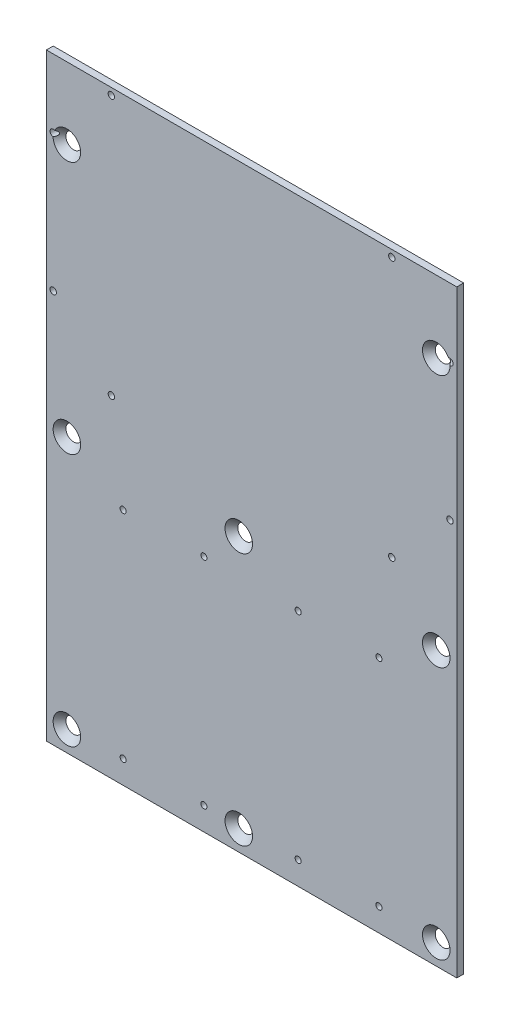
ISO-10303-21;
HEADER;
FILE_DESCRIPTION(('STEP AP214'),'2;1');
FILE_NAME('part.step','',(''),(''),'','','');
FILE_SCHEMA(('AUTOMOTIVE_DESIGN { 1 0 10303 214 1 1 1 1 }'));
ENDSEC;
DATA;
#1=APPLICATION_CONTEXT('core data for automotive mechanical design processes');
#2=APPLICATION_PROTOCOL_DEFINITION('international standard','automotive_design',2000,#1);
#3=PRODUCT_CONTEXT('',#1,'mechanical');
#4=PRODUCT('Part','Part','',(#3));
#5=PRODUCT_RELATED_PRODUCT_CATEGORY('part','',(#4));
#6=PRODUCT_DEFINITION_FORMATION('','',#4);
#7=PRODUCT_DEFINITION_CONTEXT('part definition',#1,'design');
#8=PRODUCT_DEFINITION('design','',#6,#7);
#9=PRODUCT_DEFINITION_SHAPE('','',#8);
#10=(LENGTH_UNIT() NAMED_UNIT(*) SI_UNIT(.MILLI.,.METRE.));
#11=(NAMED_UNIT(*) PLANE_ANGLE_UNIT() SI_UNIT($,.RADIAN.));
#12=(NAMED_UNIT(*) SI_UNIT($,.STERADIAN.) SOLID_ANGLE_UNIT());
#13=UNCERTAINTY_MEASURE_WITH_UNIT(LENGTH_MEASURE(1.E-05),#10,'distance_accuracy_value','');
#14=(GEOMETRIC_REPRESENTATION_CONTEXT(3) GLOBAL_UNCERTAINTY_ASSIGNED_CONTEXT((#13)) GLOBAL_UNIT_ASSIGNED_CONTEXT((#10,
#11,#12)) REPRESENTATION_CONTEXT('',''));
#15=CARTESIAN_POINT('',(0.,0.,0.));
#16=DIRECTION('',(0.,0.,1.));
#17=DIRECTION('',(1.,0.,0.));
#18=AXIS2_PLACEMENT_3D('',#15,#16,#17);
#19=CARTESIAN_POINT('',(0.,0.,0.));
#20=DIRECTION('',(0.,0.,-1.));
#21=DIRECTION('',(-1.,0.,0.));
#22=AXIS2_PLACEMENT_3D('',#19,#20,#21);
#23=PLANE('',#22);
#24=CARTESIAN_POINT('',(-4.74979999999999,-103.505,0.));
#25=DIRECTION('',(0.,0.,-1.));
#26=DIRECTION('',(-1.,0.,0.));
#27=AXIS2_PLACEMENT_3D('',#24,#25,#26);
#28=CIRCLE('',#27,2.90231388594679);
#29=CARTESIAN_POINT('',(-7.65211388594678,-103.505,0.));
#30=VERTEX_POINT('',#29);
#31=EDGE_CURVE('E39',#30,#30,#28,.T.);
#32=ORIENTED_EDGE('',*,*,#31,.F.);
#33=EDGE_LOOP('',(#32));
#34=FACE_BOUND('',#33,.T.);
#35=CARTESIAN_POINT('',(68.58,-103.505,0.));
#36=DIRECTION('',(0.,0.,-1.));
#37=DIRECTION('',(-1.,0.,0.));
#38=AXIS2_PLACEMENT_3D('',#35,#36,#37);
#39=CIRCLE('',#38,2.90231388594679);
#40=CARTESIAN_POINT('',(65.6776861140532,-103.505,0.));
#41=VERTEX_POINT('',#40);
#42=EDGE_CURVE('E313',#41,#41,#39,.T.);
#43=ORIENTED_EDGE('',*,*,#42,.F.);
#44=EDGE_LOOP('',(#43));
#45=FACE_BOUND('',#44,.T.);
#46=CARTESIAN_POINT('',(-68.5799999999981,-9.52500000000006,0.));
#47=DIRECTION('',(0.,0.,-1.));
#48=DIRECTION('',(-1.,0.,0.));
#49=AXIS2_PLACEMENT_3D('',#46,#47,#48);
#50=CIRCLE('',#49,2.90231388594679);
#51=CARTESIAN_POINT('',(-71.4823138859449,-9.52500000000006,0.));
#52=VERTEX_POINT('',#51);
#53=EDGE_CURVE('E322',#52,#52,#50,.T.);
#54=ORIENTED_EDGE('',*,*,#53,.F.);
#55=EDGE_LOOP('',(#54));
#56=FACE_BOUND('',#55,.T.);
#57=CARTESIAN_POINT('',(68.5799999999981,84.4550000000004,0.));
#58=DIRECTION('',(0.,0.,-1.));
#59=DIRECTION('',(-1.,0.,0.));
#60=AXIS2_PLACEMENT_3D('',#57,#58,#59);
#61=CIRCLE('',#60,2.90231388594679);
#62=CARTESIAN_POINT('',(65.6776861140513,84.4550000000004,0.));
#63=VERTEX_POINT('',#62);
#64=EDGE_CURVE('E93',#63,#63,#61,.T.);
#65=ORIENTED_EDGE('',*,*,#64,.F.);
#66=EDGE_LOOP('',(#65));
#67=FACE_BOUND('',#66,.T.);
#68=CARTESIAN_POINT('',(47.3,-22.545,0.));
#69=DIRECTION('',(0.,0.,1.));
#70=DIRECTION('',(1.,0.,0.));
#71=AXIS2_PLACEMENT_3D('',#68,#69,#70);
#72=CIRCLE('',#71,1.1303);
#73=CARTESIAN_POINT('',(48.4303,-22.545,0.));
#74=VERTEX_POINT('',#73);
#75=EDGE_CURVE('E343',#74,#74,#72,.T.);
#76=ORIENTED_EDGE('',*,*,#75,.T.);
#77=EDGE_LOOP('',(#76));
#78=FACE_BOUND('',#77,.T.);
#79=CARTESIAN_POINT('',(-17.7,-22.545,0.));
#80=DIRECTION('',(0.,0.,1.));
#81=DIRECTION('',(1.,0.,0.));
#82=AXIS2_PLACEMENT_3D('',#79,#80,#81);
#83=CIRCLE('',#82,1.1303);
#84=CARTESIAN_POINT('',(-16.5697,-22.545,0.));
#85=VERTEX_POINT('',#84);
#86=EDGE_CURVE('E349',#85,#85,#83,.T.);
#87=ORIENTED_EDGE('',*,*,#86,.T.);
#88=EDGE_LOOP('',(#87));
#89=FACE_BOUND('',#88,.T.);
#90=CARTESIAN_POINT('',(-47.7,-22.545,0.));
#91=DIRECTION('',(0.,0.,1.));
#92=DIRECTION('',(1.,0.,0.));
#93=AXIS2_PLACEMENT_3D('',#90,#91,#92);
#94=CIRCLE('',#93,1.1303);
#95=CARTESIAN_POINT('',(-46.5697,-22.545,0.));
#96=VERTEX_POINT('',#95);
#97=EDGE_CURVE('E355',#96,#96,#94,.T.);
#98=ORIENTED_EDGE('',*,*,#97,.T.);
#99=EDGE_LOOP('',(#98));
#100=FACE_BOUND('',#99,.T.);
#101=CARTESIAN_POINT('',(17.3,-22.545,0.));
#102=DIRECTION('',(0.,0.,1.));
#103=DIRECTION('',(1.,0.,0.));
#104=AXIS2_PLACEMENT_3D('',#101,#102,#103);
#105=CIRCLE('',#104,1.1303);
#106=CARTESIAN_POINT('',(18.4303,-22.545,0.));
#107=VERTEX_POINT('',#106);
#108=EDGE_CURVE('E361',#107,#107,#105,.T.);
#109=ORIENTED_EDGE('',*,*,#108,.T.);
#110=EDGE_LOOP('',(#109));
#111=FACE_BOUND('',#110,.T.);
#112=CARTESIAN_POINT('',(47.3,-102.545,0.));
#113=DIRECTION('',(0.,0.,1.));
#114=DIRECTION('',(1.,0.,0.));
#115=AXIS2_PLACEMENT_3D('',#112,#113,#114);
#116=CIRCLE('',#115,1.1303);
#117=CARTESIAN_POINT('',(48.4303,-102.545,0.));
#118=VERTEX_POINT('',#117);
#119=EDGE_CURVE('E367',#118,#118,#116,.T.);
#120=ORIENTED_EDGE('',*,*,#119,.T.);
#121=EDGE_LOOP('',(#120));
#122=FACE_BOUND('',#121,.T.);
#123=CARTESIAN_POINT('',(17.3,-102.545,0.));
#124=DIRECTION('',(0.,0.,1.));
#125=DIRECTION('',(1.,0.,0.));
#126=AXIS2_PLACEMENT_3D('',#123,#124,#125);
#127=CIRCLE('',#126,1.1303);
#128=CARTESIAN_POINT('',(18.4303,-102.545,0.));
#129=VERTEX_POINT('',#128);
#130=EDGE_CURVE('E373',#129,#129,#127,.T.);
#131=ORIENTED_EDGE('',*,*,#130,.T.);
#132=EDGE_LOOP('',(#131));
#133=FACE_BOUND('',#132,.T.);
#134=CARTESIAN_POINT('',(-17.7,-102.545,0.));
#135=DIRECTION('',(0.,0.,1.));
#136=DIRECTION('',(1.,0.,0.));
#137=AXIS2_PLACEMENT_3D('',#134,#135,#136);
#138=CIRCLE('',#137,1.1303);
#139=CARTESIAN_POINT('',(-16.5697,-102.545,0.));
#140=VERTEX_POINT('',#139);
#141=EDGE_CURVE('E379',#140,#140,#138,.T.);
#142=ORIENTED_EDGE('',*,*,#141,.T.);
#143=EDGE_LOOP('',(#142));
#144=FACE_BOUND('',#143,.T.);
#145=CARTESIAN_POINT('',(-47.7,-102.545,0.));
#146=DIRECTION('',(0.,0.,1.));
#147=DIRECTION('',(1.,0.,0.));
#148=AXIS2_PLACEMENT_3D('',#145,#146,#147);
#149=CIRCLE('',#148,1.1303);
#150=CARTESIAN_POINT('',(-46.5697,-102.545,0.));
#151=VERTEX_POINT('',#150);
#152=EDGE_CURVE('E385',#151,#151,#149,.T.);
#153=ORIENTED_EDGE('',*,*,#152,.T.);
#154=EDGE_LOOP('',(#153));
#155=FACE_BOUND('',#154,.T.);
#156=CARTESIAN_POINT('',(52.07,108.585,0.));
#157=DIRECTION('',(0.,0.,1.));
#158=DIRECTION('',(1.,0.,0.));
#159=AXIS2_PLACEMENT_3D('',#156,#157,#158);
#160=CIRCLE('',#159,1.190625);
#161=CARTESIAN_POINT('',(53.260625,108.585,0.));
#162=VERTEX_POINT('',#161);
#163=EDGE_CURVE('E98',#162,#162,#160,.T.);
#164=ORIENTED_EDGE('',*,*,#163,.T.);
#165=EDGE_LOOP('',(#164));
#166=FACE_BOUND('',#165,.T.);
#167=CARTESIAN_POINT('',(73.66,85.7249999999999,0.));
#168=DIRECTION('',(0.,0.,1.));
#169=DIRECTION('',(1.,0.,0.));
#170=AXIS2_PLACEMENT_3D('',#167,#168,#169);
#171=CIRCLE('',#170,1.190625);
#172=CARTESIAN_POINT('',(74.850625,85.7249999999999,0.));
#173=VERTEX_POINT('',#172);
#174=EDGE_CURVE('E97',#173,#173,#171,.T.);
#175=ORIENTED_EDGE('',*,*,#174,.T.);
#176=EDGE_LOOP('',(#175));
#177=FACE_BOUND('',#176,.T.);
#178=CARTESIAN_POINT('',(73.66,34.9249999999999,0.));
#179=DIRECTION('',(0.,0.,1.));
#180=DIRECTION('',(1.,0.,0.));
#181=AXIS2_PLACEMENT_3D('',#178,#179,#180);
#182=CIRCLE('',#181,1.190625);
#183=CARTESIAN_POINT('',(74.850625,34.9249999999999,0.));
#184=VERTEX_POINT('',#183);
#185=EDGE_CURVE('E110',#184,#184,#182,.T.);
#186=ORIENTED_EDGE('',*,*,#185,.T.);
#187=EDGE_LOOP('',(#186));
#188=FACE_BOUND('',#187,.T.);
#189=CARTESIAN_POINT('',(52.07,12.0649999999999,0.));
#190=DIRECTION('',(0.,0.,1.));
#191=DIRECTION('',(1.,0.,0.));
#192=AXIS2_PLACEMENT_3D('',#189,#190,#191);
#193=CIRCLE('',#192,1.190625);
#194=CARTESIAN_POINT('',(53.260625,12.0649999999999,0.));
#195=VERTEX_POINT('',#194);
#196=EDGE_CURVE('E116',#195,#195,#193,.T.);
#197=ORIENTED_EDGE('',*,*,#196,.T.);
#198=EDGE_LOOP('',(#197));
#199=FACE_BOUND('',#198,.T.);
#200=CARTESIAN_POINT('',(-52.07,12.0649999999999,0.));
#201=DIRECTION('',(0.,0.,1.));
#202=DIRECTION('',(1.,0.,0.));
#203=AXIS2_PLACEMENT_3D('',#200,#201,#202);
#204=CIRCLE('',#203,1.190625);
#205=CARTESIAN_POINT('',(-50.879375,12.0649999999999,0.));
#206=VERTEX_POINT('',#205);
#207=EDGE_CURVE('E122',#206,#206,#204,.T.);
#208=ORIENTED_EDGE('',*,*,#207,.T.);
#209=EDGE_LOOP('',(#208));
#210=FACE_BOUND('',#209,.T.);
#211=CARTESIAN_POINT('',(-73.66,34.9249999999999,0.));
#212=DIRECTION('',(0.,0.,1.));
#213=DIRECTION('',(1.,0.,0.));
#214=AXIS2_PLACEMENT_3D('',#211,#212,#213);
#215=CIRCLE('',#214,1.190625);
#216=CARTESIAN_POINT('',(-72.469375,34.9249999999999,0.));
#217=VERTEX_POINT('',#216);
#218=EDGE_CURVE('E128',#217,#217,#215,.T.);
#219=ORIENTED_EDGE('',*,*,#218,.T.);
#220=EDGE_LOOP('',(#219));
#221=FACE_BOUND('',#220,.T.);
#222=CARTESIAN_POINT('',(-52.07,108.585,0.));
#223=DIRECTION('',(0.,0.,1.));
#224=DIRECTION('',(1.,0.,0.));
#225=AXIS2_PLACEMENT_3D('',#222,#223,#224);
#226=CIRCLE('',#225,1.190625);
#227=CARTESIAN_POINT('',(-50.879375,108.585,0.));
#228=VERTEX_POINT('',#227);
#229=EDGE_CURVE('E134',#228,#228,#226,.T.);
#230=ORIENTED_EDGE('',*,*,#229,.T.);
#231=EDGE_LOOP('',(#230));
#232=FACE_BOUND('',#231,.T.);
#233=CARTESIAN_POINT('',(-73.66,85.7249999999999,0.));
#234=DIRECTION('',(0.,0.,1.));
#235=DIRECTION('',(1.,0.,0.));
#236=AXIS2_PLACEMENT_3D('',#233,#234,#235);
#237=CIRCLE('',#236,1.190625);
#238=CARTESIAN_POINT('',(-72.469375,85.7249999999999,0.));
#239=VERTEX_POINT('',#238);
#240=EDGE_CURVE('E140',#239,#239,#237,.T.);
#241=ORIENTED_EDGE('',*,*,#240,.T.);
#242=EDGE_LOOP('',(#241));
#243=FACE_BOUND('',#242,.T.);
#244=DIRECTION('',(0.,1.,0.));
#245=VECTOR('',#244,1.);
#246=CARTESIAN_POINT('',(76.2,-111.125,0.));
#247=LINE('',#246,#245);
#248=CARTESIAN_POINT('',(76.2,-111.125,0.));
#249=VERTEX_POINT('',#248);
#250=CARTESIAN_POINT('',(76.2,111.125,0.));
#251=VERTEX_POINT('',#250);
#252=EDGE_CURVE('E143',#249,#251,#247,.T.);
#253=ORIENTED_EDGE('',*,*,#252,.F.);
#254=DIRECTION('',(1.,0.,0.));
#255=VECTOR('',#254,1.);
#256=CARTESIAN_POINT('',(-76.2,-111.125,0.));
#257=LINE('',#256,#255);
#258=CARTESIAN_POINT('',(-76.2,-111.125,0.));
#259=VERTEX_POINT('',#258);
#260=EDGE_CURVE('E148',#259,#249,#257,.T.);
#261=ORIENTED_EDGE('',*,*,#260,.F.);
#262=DIRECTION('',(0.,-1.,0.));
#263=VECTOR('',#262,1.);
#264=CARTESIAN_POINT('',(-76.2,-111.125,0.));
#265=LINE('',#264,#263);
#266=CARTESIAN_POINT('',(-76.2,111.125,0.));
#267=VERTEX_POINT('',#266);
#268=EDGE_CURVE('E159',#267,#259,#265,.T.);
#269=ORIENTED_EDGE('',*,*,#268,.F.);
#270=DIRECTION('',(-1.,0.,0.));
#271=VECTOR('',#270,1.);
#272=CARTESIAN_POINT('',(-76.2,111.125,0.));
#273=LINE('',#272,#271);
#274=EDGE_CURVE('E157',#251,#267,#273,.T.);
#275=ORIENTED_EDGE('',*,*,#274,.F.);
#276=EDGE_LOOP('',(#253,#261,#269,#275));
#277=FACE_BOUND('',#276,.T.);
#278=CARTESIAN_POINT('',(-68.5799999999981,84.4550000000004,0.));
#279=DIRECTION('',(0.,0.,-1.));
#280=DIRECTION('',(-1.,0.,0.));
#281=AXIS2_PLACEMENT_3D('',#278,#279,#280);
#282=CIRCLE('',#281,2.90231388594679);
#283=CARTESIAN_POINT('',(-71.4823138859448,84.4550000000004,0.));
#284=VERTEX_POINT('',#283);
#285=EDGE_CURVE('E298',#284,#284,#282,.T.);
#286=ORIENTED_EDGE('',*,*,#285,.F.);
#287=EDGE_LOOP('',(#286));
#288=FACE_BOUND('',#287,.T.);
#289=CARTESIAN_POINT('',(68.5799999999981,-9.52500000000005,0.));
#290=DIRECTION('',(0.,0.,-1.));
#291=DIRECTION('',(-1.,0.,0.));
#292=AXIS2_PLACEMENT_3D('',#289,#290,#291);
#293=CIRCLE('',#292,2.90231388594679);
#294=CARTESIAN_POINT('',(65.6776861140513,-9.52500000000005,0.));
#295=VERTEX_POINT('',#294);
#296=EDGE_CURVE('E94',#295,#295,#293,.T.);
#297=ORIENTED_EDGE('',*,*,#296,.F.);
#298=EDGE_LOOP('',(#297));
#299=FACE_BOUND('',#298,.T.);
#300=CARTESIAN_POINT('',(-4.7498000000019,-9.52500000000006,0.));
#301=DIRECTION('',(0.,0.,-1.));
#302=DIRECTION('',(-1.,0.,0.));
#303=AXIS2_PLACEMENT_3D('',#300,#301,#302);
#304=CIRCLE('',#303,2.90231388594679);
#305=CARTESIAN_POINT('',(-7.65211388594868,-9.52500000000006,0.));
#306=VERTEX_POINT('',#305);
#307=EDGE_CURVE('E305',#306,#306,#304,.T.);
#308=ORIENTED_EDGE('',*,*,#307,.F.);
#309=EDGE_LOOP('',(#308));
#310=FACE_BOUND('',#309,.T.);
#311=CARTESIAN_POINT('',(-68.58,-103.505,0.));
#312=DIRECTION('',(0.,0.,-1.));
#313=DIRECTION('',(-1.,0.,0.));
#314=AXIS2_PLACEMENT_3D('',#311,#312,#313);
#315=CIRCLE('',#314,2.90231388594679);
#316=CARTESIAN_POINT('',(-71.4823138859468,-103.505,0.));
#317=VERTEX_POINT('',#316);
#318=EDGE_CURVE('E308',#317,#317,#315,.T.);
#319=ORIENTED_EDGE('',*,*,#318,.F.);
#320=EDGE_LOOP('',(#319));
#321=FACE_BOUND('',#320,.T.);
#322=ADVANCED_FACE('F35',(#34,#45,#56,#67,#78,#89,#100,#111,#122,#133,#144,#155,#166,#177,#188,
#199,#210,#221,#232,#243,#277,#288,#299,#310,#321),#23,.T.);
#323=CARTESIAN_POINT('',(0.,0.,2.54));
#324=DIRECTION('',(0.,0.,-1.));
#325=DIRECTION('',(-1.,0.,0.));
#326=AXIS2_PLACEMENT_3D('',#323,#324,#325);
#327=PLANE('',#326);
#328=CARTESIAN_POINT('',(-4.74979999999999,-103.505,2.54));
#329=DIRECTION('',(0.,0.,1.));
#330=DIRECTION('',(1.,0.,0.));
#331=AXIS2_PLACEMENT_3D('',#328,#329,#330);
#332=CIRCLE('',#331,5.1103022);
#333=CARTESIAN_POINT('',(0.360502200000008,-103.505,2.54));
#334=VERTEX_POINT('',#333);
#335=EDGE_CURVE('E499',#334,#334,#332,.T.);
#336=ORIENTED_EDGE('',*,*,#335,.F.);
#337=EDGE_LOOP('',(#336));
#338=FACE_BOUND('',#337,.T.);
#339=CARTESIAN_POINT('',(-68.58,-103.505,2.54));
#340=DIRECTION('',(0.,0.,1.));
#341=DIRECTION('',(1.,0.,0.));
#342=AXIS2_PLACEMENT_3D('',#339,#340,#341);
#343=CIRCLE('',#342,5.1103022);
#344=CARTESIAN_POINT('',(-63.4696978,-103.505,2.54));
#345=VERTEX_POINT('',#344);
#346=EDGE_CURVE('E311',#345,#345,#343,.T.);
#347=ORIENTED_EDGE('',*,*,#346,.F.);
#348=EDGE_LOOP('',(#347));
#349=FACE_BOUND('',#348,.T.);
#350=CARTESIAN_POINT('',(68.58,-103.505,2.54));
#351=DIRECTION('',(0.,0.,1.));
#352=DIRECTION('',(1.,0.,0.));
#353=AXIS2_PLACEMENT_3D('',#350,#351,#352);
#354=CIRCLE('',#353,5.1103022);
#355=CARTESIAN_POINT('',(73.6903022,-103.505,2.54));
#356=VERTEX_POINT('',#355);
#357=EDGE_CURVE('E310',#356,#356,#354,.T.);
#358=ORIENTED_EDGE('',*,*,#357,.F.);
#359=EDGE_LOOP('',(#358));
#360=FACE_BOUND('',#359,.T.);
#361=CARTESIAN_POINT('',(-4.7498000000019,-9.52500000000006,2.54));
#362=DIRECTION('',(0.,0.,1.));
#363=DIRECTION('',(1.,0.,0.));
#364=AXIS2_PLACEMENT_3D('',#361,#362,#363);
#365=CIRCLE('',#364,5.1103022);
#366=CARTESIAN_POINT('',(0.360502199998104,-9.52500000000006,2.54));
#367=VERTEX_POINT('',#366);
#368=EDGE_CURVE('E320',#367,#367,#365,.T.);
#369=ORIENTED_EDGE('',*,*,#368,.F.);
#370=EDGE_LOOP('',(#369));
#371=FACE_BOUND('',#370,.T.);
#372=CARTESIAN_POINT('',(-68.5799999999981,-9.52500000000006,2.54));
#373=DIRECTION('',(0.,0.,1.));
#374=DIRECTION('',(1.,0.,0.));
#375=AXIS2_PLACEMENT_3D('',#372,#373,#374);
#376=CIRCLE('',#375,5.1103022);
#377=CARTESIAN_POINT('',(-63.4696977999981,-9.52500000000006,2.54));
#378=VERTEX_POINT('',#377);
#379=EDGE_CURVE('E321',#378,#378,#376,.T.);
#380=ORIENTED_EDGE('',*,*,#379,.F.);
#381=EDGE_LOOP('',(#380));
#382=FACE_BOUND('',#381,.T.);
#383=CARTESIAN_POINT('',(68.5799999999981,-9.52500000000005,2.54));
#384=DIRECTION('',(0.,0.,1.));
#385=DIRECTION('',(1.,0.,0.));
#386=AXIS2_PLACEMENT_3D('',#383,#384,#385);
#387=CIRCLE('',#386,5.1103022);
#388=CARTESIAN_POINT('',(73.6903021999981,-9.52500000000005,2.54));
#389=VERTEX_POINT('',#388);
#390=EDGE_CURVE('E324',#389,#389,#387,.T.);
#391=ORIENTED_EDGE('',*,*,#390,.F.);
#392=EDGE_LOOP('',(#391));
#393=FACE_BOUND('',#392,.T.);
#394=CARTESIAN_POINT('',(-68.5799999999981,84.4550000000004,2.54));
#395=DIRECTION('',(0.,0.,1.));
#396=DIRECTION('',(1.,0.,0.));
#397=AXIS2_PLACEMENT_3D('',#394,#395,#396);
#398=CIRCLE('',#397,5.1103022);
#399=CARTESIAN_POINT('',(-73.6896799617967,84.5347449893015,2.54));
#400=VERTEX_POINT('',#399);
#401=CARTESIAN_POINT('',(-73.1260681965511,86.7891920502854,2.54));
#402=VERTEX_POINT('',#401);
#403=EDGE_CURVE('E57',#400,#402,#398,.T.);
#404=ORIENTED_EDGE('',*,*,#403,.F.);
#405=CARTESIAN_POINT('',(-73.66,85.7249999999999,2.54));
#406=DIRECTION('',(0.,0.,1.));
#407=DIRECTION('',(1.,0.,0.));
#408=AXIS2_PLACEMENT_3D('',#405,#406,#407);
#409=CIRCLE('',#408,1.19062499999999);
#410=EDGE_CURVE('E137',#402,#400,#409,.T.);
#411=ORIENTED_EDGE('',*,*,#410,.F.);
#412=EDGE_LOOP('',(#404,#411));
#413=FACE_BOUND('',#412,.T.);
#414=CARTESIAN_POINT('',(47.3,-22.545,2.54));
#415=DIRECTION('',(0.,0.,1.));
#416=DIRECTION('',(1.,0.,0.));
#417=AXIS2_PLACEMENT_3D('',#414,#415,#416);
#418=CIRCLE('',#417,1.1303);
#419=CARTESIAN_POINT('',(48.4303,-22.545,2.54));
#420=VERTEX_POINT('',#419);
#421=EDGE_CURVE('E340',#420,#420,#418,.T.);
#422=ORIENTED_EDGE('',*,*,#421,.F.);
#423=EDGE_LOOP('',(#422));
#424=FACE_BOUND('',#423,.T.);
#425=CARTESIAN_POINT('',(-17.7,-22.545,2.54));
#426=DIRECTION('',(0.,0.,1.));
#427=DIRECTION('',(1.,0.,0.));
#428=AXIS2_PLACEMENT_3D('',#425,#426,#427);
#429=CIRCLE('',#428,1.1303);
#430=CARTESIAN_POINT('',(-16.5697,-22.545,2.54));
#431=VERTEX_POINT('',#430);
#432=EDGE_CURVE('E346',#431,#431,#429,.T.);
#433=ORIENTED_EDGE('',*,*,#432,.F.);
#434=EDGE_LOOP('',(#433));
#435=FACE_BOUND('',#434,.T.);
#436=CARTESIAN_POINT('',(-47.7,-22.545,2.54));
#437=DIRECTION('',(0.,0.,1.));
#438=DIRECTION('',(1.,0.,0.));
#439=AXIS2_PLACEMENT_3D('',#436,#437,#438);
#440=CIRCLE('',#439,1.1303);
#441=CARTESIAN_POINT('',(-46.5697,-22.545,2.54));
#442=VERTEX_POINT('',#441);
#443=EDGE_CURVE('E352',#442,#442,#440,.T.);
#444=ORIENTED_EDGE('',*,*,#443,.F.);
#445=EDGE_LOOP('',(#444));
#446=FACE_BOUND('',#445,.T.);
#447=CARTESIAN_POINT('',(17.3,-22.545,2.54));
#448=DIRECTION('',(0.,0.,1.));
#449=DIRECTION('',(1.,0.,0.));
#450=AXIS2_PLACEMENT_3D('',#447,#448,#449);
#451=CIRCLE('',#450,1.1303);
#452=CARTESIAN_POINT('',(18.4303,-22.545,2.54));
#453=VERTEX_POINT('',#452);
#454=EDGE_CURVE('E358',#453,#453,#451,.T.);
#455=ORIENTED_EDGE('',*,*,#454,.F.);
#456=EDGE_LOOP('',(#455));
#457=FACE_BOUND('',#456,.T.);
#458=CARTESIAN_POINT('',(47.3,-102.545,2.54));
#459=DIRECTION('',(0.,0.,1.));
#460=DIRECTION('',(1.,0.,0.));
#461=AXIS2_PLACEMENT_3D('',#458,#459,#460);
#462=CIRCLE('',#461,1.1303);
#463=CARTESIAN_POINT('',(48.4303,-102.545,2.54));
#464=VERTEX_POINT('',#463);
#465=EDGE_CURVE('E364',#464,#464,#462,.T.);
#466=ORIENTED_EDGE('',*,*,#465,.F.);
#467=EDGE_LOOP('',(#466));
#468=FACE_BOUND('',#467,.T.);
#469=CARTESIAN_POINT('',(17.3,-102.545,2.54));
#470=DIRECTION('',(0.,0.,1.));
#471=DIRECTION('',(1.,0.,0.));
#472=AXIS2_PLACEMENT_3D('',#469,#470,#471);
#473=CIRCLE('',#472,1.1303);
#474=CARTESIAN_POINT('',(18.4303,-102.545,2.54));
#475=VERTEX_POINT('',#474);
#476=EDGE_CURVE('E370',#475,#475,#473,.T.);
#477=ORIENTED_EDGE('',*,*,#476,.F.);
#478=EDGE_LOOP('',(#477));
#479=FACE_BOUND('',#478,.T.);
#480=CARTESIAN_POINT('',(-17.7,-102.545,2.54));
#481=DIRECTION('',(0.,0.,1.));
#482=DIRECTION('',(1.,0.,0.));
#483=AXIS2_PLACEMENT_3D('',#480,#481,#482);
#484=CIRCLE('',#483,1.1303);
#485=CARTESIAN_POINT('',(-16.5697,-102.545,2.54));
#486=VERTEX_POINT('',#485);
#487=EDGE_CURVE('E376',#486,#486,#484,.T.);
#488=ORIENTED_EDGE('',*,*,#487,.F.);
#489=EDGE_LOOP('',(#488));
#490=FACE_BOUND('',#489,.T.);
#491=CARTESIAN_POINT('',(-47.7,-102.545,2.54));
#492=DIRECTION('',(0.,0.,1.));
#493=DIRECTION('',(1.,0.,0.));
#494=AXIS2_PLACEMENT_3D('',#491,#492,#493);
#495=CIRCLE('',#494,1.1303);
#496=CARTESIAN_POINT('',(-46.5697,-102.545,2.54));
#497=VERTEX_POINT('',#496);
#498=EDGE_CURVE('E382',#497,#497,#495,.T.);
#499=ORIENTED_EDGE('',*,*,#498,.F.);
#500=EDGE_LOOP('',(#499));
#501=FACE_BOUND('',#500,.T.);
#502=CARTESIAN_POINT('',(52.07,108.585,2.54));
#503=DIRECTION('',(0.,0.,1.));
#504=DIRECTION('',(1.,0.,0.));
#505=AXIS2_PLACEMENT_3D('',#502,#503,#504);
#506=CIRCLE('',#505,1.19062499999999);
#507=CARTESIAN_POINT('',(53.260625,108.585,2.54));
#508=VERTEX_POINT('',#507);
#509=EDGE_CURVE('E104',#508,#508,#506,.T.);
#510=ORIENTED_EDGE('',*,*,#509,.F.);
#511=EDGE_LOOP('',(#510));
#512=FACE_BOUND('',#511,.T.);
#513=CARTESIAN_POINT('',(73.66,34.9249999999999,2.54));
#514=DIRECTION('',(0.,0.,1.));
#515=DIRECTION('',(1.,0.,0.));
#516=AXIS2_PLACEMENT_3D('',#513,#514,#515);
#517=CIRCLE('',#516,1.19062499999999);
#518=CARTESIAN_POINT('',(74.850625,34.9249999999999,2.54));
#519=VERTEX_POINT('',#518);
#520=EDGE_CURVE('E101',#519,#519,#517,.T.);
#521=ORIENTED_EDGE('',*,*,#520,.F.);
#522=EDGE_LOOP('',(#521));
#523=FACE_BOUND('',#522,.T.);
#524=CARTESIAN_POINT('',(52.07,12.0649999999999,2.54));
#525=DIRECTION('',(0.,0.,1.));
#526=DIRECTION('',(1.,0.,0.));
#527=AXIS2_PLACEMENT_3D('',#524,#525,#526);
#528=CIRCLE('',#527,1.19062499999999);
#529=CARTESIAN_POINT('',(53.260625,12.0649999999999,2.54));
#530=VERTEX_POINT('',#529);
#531=EDGE_CURVE('E113',#530,#530,#528,.T.);
#532=ORIENTED_EDGE('',*,*,#531,.F.);
#533=EDGE_LOOP('',(#532));
#534=FACE_BOUND('',#533,.T.);
#535=CARTESIAN_POINT('',(-52.07,12.0649999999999,2.54));
#536=DIRECTION('',(0.,0.,1.));
#537=DIRECTION('',(1.,0.,0.));
#538=AXIS2_PLACEMENT_3D('',#535,#536,#537);
#539=CIRCLE('',#538,1.19062499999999);
#540=CARTESIAN_POINT('',(-50.879375,12.0649999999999,2.54));
#541=VERTEX_POINT('',#540);
#542=EDGE_CURVE('E119',#541,#541,#539,.T.);
#543=ORIENTED_EDGE('',*,*,#542,.F.);
#544=EDGE_LOOP('',(#543));
#545=FACE_BOUND('',#544,.T.);
#546=CARTESIAN_POINT('',(-73.66,34.9249999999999,2.54));
#547=DIRECTION('',(0.,0.,1.));
#548=DIRECTION('',(1.,0.,0.));
#549=AXIS2_PLACEMENT_3D('',#546,#547,#548);
#550=CIRCLE('',#549,1.19062499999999);
#551=CARTESIAN_POINT('',(-72.469375,34.9249999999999,2.54));
#552=VERTEX_POINT('',#551);
#553=EDGE_CURVE('E125',#552,#552,#550,.T.);
#554=ORIENTED_EDGE('',*,*,#553,.F.);
#555=EDGE_LOOP('',(#554));
#556=FACE_BOUND('',#555,.T.);
#557=CARTESIAN_POINT('',(-52.07,108.585,2.54));
#558=DIRECTION('',(0.,0.,1.));
#559=DIRECTION('',(1.,0.,0.));
#560=AXIS2_PLACEMENT_3D('',#557,#558,#559);
#561=CIRCLE('',#560,1.19062499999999);
#562=CARTESIAN_POINT('',(-50.879375,108.585,2.54));
#563=VERTEX_POINT('',#562);
#564=EDGE_CURVE('E131',#563,#563,#561,.T.);
#565=ORIENTED_EDGE('',*,*,#564,.F.);
#566=EDGE_LOOP('',(#565));
#567=FACE_BOUND('',#566,.T.);
#568=DIRECTION('',(0.,1.,0.));
#569=VECTOR('',#568,1.);
#570=CARTESIAN_POINT('',(76.2,-111.125,2.54));
#571=LINE('',#570,#569);
#572=CARTESIAN_POINT('',(76.2,-111.125,2.54));
#573=VERTEX_POINT('',#572);
#574=CARTESIAN_POINT('',(76.2,111.125,2.54));
#575=VERTEX_POINT('',#574);
#576=EDGE_CURVE('E144',#573,#575,#571,.T.);
#577=ORIENTED_EDGE('',*,*,#576,.T.);
#578=DIRECTION('',(-1.,0.,0.));
#579=VECTOR('',#578,1.);
#580=CARTESIAN_POINT('',(-76.2,111.125,2.54));
#581=LINE('',#580,#579);
#582=CARTESIAN_POINT('',(-76.2,111.125,2.54));
#583=VERTEX_POINT('',#582);
#584=EDGE_CURVE('E147',#575,#583,#581,.T.);
#585=ORIENTED_EDGE('',*,*,#584,.T.);
#586=DIRECTION('',(0.,-1.,0.));
#587=VECTOR('',#586,1.);
#588=CARTESIAN_POINT('',(-76.2,-111.125,2.54));
#589=LINE('',#588,#587);
#590=CARTESIAN_POINT('',(-76.2,-111.125,2.54));
#591=VERTEX_POINT('',#590);
#592=EDGE_CURVE('E150',#583,#591,#589,.T.);
#593=ORIENTED_EDGE('',*,*,#592,.T.);
#594=DIRECTION('',(1.,0.,0.));
#595=VECTOR('',#594,1.);
#596=CARTESIAN_POINT('',(-76.2,-111.125,2.54));
#597=LINE('',#596,#595);
#598=EDGE_CURVE('E152',#591,#573,#597,.T.);
#599=ORIENTED_EDGE('',*,*,#598,.T.);
#600=EDGE_LOOP('',(#577,#585,#593,#599));
#601=FACE_BOUND('',#600,.T.);
#602=CARTESIAN_POINT('',(68.5799999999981,84.4550000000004,2.54));
#603=DIRECTION('',(0.,0.,1.));
#604=DIRECTION('',(1.,0.,0.));
#605=AXIS2_PLACEMENT_3D('',#602,#603,#604);
#606=CIRCLE('',#605,5.1103022);
#607=CARTESIAN_POINT('',(73.1260681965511,86.7891920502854,2.54));
#608=VERTEX_POINT('',#607);
#609=CARTESIAN_POINT('',(73.6896799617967,84.5347449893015,2.54));
#610=VERTEX_POINT('',#609);
#611=EDGE_CURVE('E51',#608,#610,#606,.T.);
#612=ORIENTED_EDGE('',*,*,#611,.F.);
#613=CARTESIAN_POINT('',(73.66,85.7249999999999,2.54));
#614=DIRECTION('',(0.,0.,1.));
#615=DIRECTION('',(1.,0.,0.));
#616=AXIS2_PLACEMENT_3D('',#613,#614,#615);
#617=CIRCLE('',#616,1.19062499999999);
#618=EDGE_CURVE('E92',#610,#608,#617,.T.);
#619=ORIENTED_EDGE('',*,*,#618,.F.);
#620=EDGE_LOOP('',(#612,#619));
#621=FACE_BOUND('',#620,.T.);
#622=ADVANCED_FACE('F91',(#338,#349,#360,#371,#382,#393,#413,#424,#435,#446,#457,#468,#479,#490,
#501,#512,#523,#534,#545,#556,#567,#601,#621),#327,.F.);
#623=CARTESIAN_POINT('',(76.2,-111.125,2.54));
#624=DIRECTION('',(-1.,0.,0.));
#625=DIRECTION('',(0.,0.,1.));
#626=AXIS2_PLACEMENT_3D('',#623,#624,#625);
#627=PLANE('',#626);
#628=ORIENTED_EDGE('',*,*,#252,.T.);
#629=DIRECTION('',(0.,0.,-1.));
#630=VECTOR('',#629,1.);
#631=CARTESIAN_POINT('',(76.2,111.125,2.54));
#632=LINE('',#631,#630);
#633=EDGE_CURVE('E170',#575,#251,#632,.T.);
#634=ORIENTED_EDGE('',*,*,#633,.F.);
#635=ORIENTED_EDGE('',*,*,#576,.F.);
#636=DIRECTION('',(0.,0.,-1.));
#637=VECTOR('',#636,1.);
#638=CARTESIAN_POINT('',(76.2,-111.125,2.54));
#639=LINE('',#638,#637);
#640=EDGE_CURVE('E154',#573,#249,#639,.T.);
#641=ORIENTED_EDGE('',*,*,#640,.T.);
#642=EDGE_LOOP('',(#628,#634,#635,#641));
#643=FACE_BOUND('',#642,.T.);
#644=ADVANCED_FACE('F37',(#643),#627,.F.);
#645=CARTESIAN_POINT('',(-76.2,111.125,2.54));
#646=DIRECTION('',(0.,-1.,0.));
#647=DIRECTION('',(0.,0.,-1.));
#648=AXIS2_PLACEMENT_3D('',#645,#646,#647);
#649=PLANE('',#648);
#650=ORIENTED_EDGE('',*,*,#274,.T.);
#651=DIRECTION('',(0.,0.,-1.));
#652=VECTOR('',#651,1.);
#653=CARTESIAN_POINT('',(-76.2,111.125,2.54));
#654=LINE('',#653,#652);
#655=EDGE_CURVE('E167',#583,#267,#654,.T.);
#656=ORIENTED_EDGE('',*,*,#655,.F.);
#657=ORIENTED_EDGE('',*,*,#584,.F.);
#658=ORIENTED_EDGE('',*,*,#633,.T.);
#659=EDGE_LOOP('',(#650,#656,#657,#658));
#660=FACE_BOUND('',#659,.T.);
#661=ADVANCED_FACE('F274',(#660),#649,.F.);
#662=CARTESIAN_POINT('',(-76.2,-111.125,2.54));
#663=DIRECTION('',(1.,0.,0.));
#664=DIRECTION('',(0.,0.,-1.));
#665=AXIS2_PLACEMENT_3D('',#662,#663,#664);
#666=PLANE('',#665);
#667=ORIENTED_EDGE('',*,*,#268,.T.);
#668=DIRECTION('',(0.,0.,-1.));
#669=VECTOR('',#668,1.);
#670=CARTESIAN_POINT('',(-76.2,-111.125,2.54));
#671=LINE('',#670,#669);
#672=EDGE_CURVE('E164',#591,#259,#671,.T.);
#673=ORIENTED_EDGE('',*,*,#672,.F.);
#674=ORIENTED_EDGE('',*,*,#592,.F.);
#675=ORIENTED_EDGE('',*,*,#655,.T.);
#676=EDGE_LOOP('',(#667,#673,#674,#675));
#677=FACE_BOUND('',#676,.T.);
#678=ADVANCED_FACE('F271',(#677),#666,.F.);
#679=CARTESIAN_POINT('',(-76.2,-111.125,2.54));
#680=DIRECTION('',(0.,1.,0.));
#681=DIRECTION('',(0.,0.,1.));
#682=AXIS2_PLACEMENT_3D('',#679,#680,#681);
#683=PLANE('',#682);
#684=ORIENTED_EDGE('',*,*,#260,.T.);
#685=ORIENTED_EDGE('',*,*,#640,.F.);
#686=ORIENTED_EDGE('',*,*,#598,.F.);
#687=ORIENTED_EDGE('',*,*,#672,.T.);
#688=EDGE_LOOP('',(#684,#685,#686,#687));
#689=FACE_BOUND('',#688,.T.);
#690=ADVANCED_FACE('F255',(#689),#683,.F.);
#691=CARTESIAN_POINT('',(-73.66,85.7249999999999,2.54));
#692=DIRECTION('',(0.,0.,1.));
#693=DIRECTION('',(1.,0.,0.));
#694=AXIS2_PLACEMENT_3D('',#691,#692,#693);
#695=CYLINDRICAL_SURFACE('',#694,1.19062499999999);
#696=ORIENTED_EDGE('',*,*,#240,.F.);
#697=EDGE_LOOP('',(#696));
#698=FACE_BOUND('',#697,.T.);
#699=ORIENTED_EDGE('',*,*,#410,.T.);
#700=CARTESIAN_POINT('',(-73.6898537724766,84.5347493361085,2.5402));
#701=CARTESIAN_POINT('',(-73.640784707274,84.5335445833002,2.48375372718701));
#702=CARTESIAN_POINT('',(-73.5916619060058,84.5353243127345,2.42726845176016));
#703=CARTESIAN_POINT('',(-73.4934796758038,84.5450358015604,2.31452224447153));
#704=CARTESIAN_POINT('',(-73.4444207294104,84.5529832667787,2.25826225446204));
#705=CARTESIAN_POINT('',(-73.3462321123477,84.5753484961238,2.14592273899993));
#706=CARTESIAN_POINT('',(-73.2971080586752,84.5898392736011,2.08985264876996));
#707=CARTESIAN_POINT('',(-73.1997485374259,84.6257063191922,1.97926145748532));
#708=CARTESIAN_POINT('',(-73.1515120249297,84.6470738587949,1.92473848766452));
#709=CARTESIAN_POINT('',(-73.0571071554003,84.6969382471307,1.81901355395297));
#710=CARTESIAN_POINT('',(-73.0109175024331,84.7253062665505,1.76777062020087));
#711=CARTESIAN_POINT('',(-72.9204291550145,84.7902704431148,1.6690684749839));
#712=CARTESIAN_POINT('',(-72.8761263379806,84.8268474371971,1.62160079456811));
#713=CARTESIAN_POINT('',(-72.7994945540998,84.9007911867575,1.54208583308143));
#714=CARTESIAN_POINT('',(-72.7666173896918,84.9363487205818,1.50890220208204));
#715=CARTESIAN_POINT('',(-72.7036075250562,85.0140900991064,1.4480913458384));
#716=CARTESIAN_POINT('',(-72.6734696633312,85.0562610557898,1.42045354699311));
#717=CARTESIAN_POINT('',(-72.6255049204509,85.1343559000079,1.38008026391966));
#718=CARTESIAN_POINT('',(-72.6066297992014,85.1685898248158,1.36534481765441));
#719=CARTESIAN_POINT('',(-72.571793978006,85.2402555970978,1.34110303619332));
#720=CARTESIAN_POINT('',(-72.5558300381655,85.2776838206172,1.33159086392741));
#721=CARTESIAN_POINT('',(-72.5274894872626,85.3552408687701,1.31868893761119));
#722=CARTESIAN_POINT('',(-72.5151402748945,85.3953876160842,1.31534497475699));
#723=CARTESIAN_POINT('',(-72.4947840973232,85.4767697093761,1.31532962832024));
#724=CARTESIAN_POINT('',(-72.4867768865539,85.5180049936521,1.31865786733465));
#725=CARTESIAN_POINT('',(-72.4758038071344,85.5959263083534,1.33091973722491));
#726=CARTESIAN_POINT('',(-72.4724108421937,85.6326516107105,1.3392540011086));
#727=CARTESIAN_POINT('',(-72.4689921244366,85.7049752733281,1.36027743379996));
#728=CARTESIAN_POINT('',(-72.4689678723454,85.7405731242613,1.3729685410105));
#729=CARTESIAN_POINT('',(-72.472683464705,85.8283429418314,1.40946392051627));
#730=CARTESIAN_POINT('',(-72.4783971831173,85.8794536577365,1.43560977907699));
#731=CARTESIAN_POINT('',(-72.4953560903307,85.977336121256,1.49359502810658));
#732=CARTESIAN_POINT('',(-72.506615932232,86.024095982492,1.52544935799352));
#733=CARTESIAN_POINT('',(-72.541611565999,86.1401836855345,1.61331063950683));
#734=CARTESIAN_POINT('',(-72.568778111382,86.2061779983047,1.67232448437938));
#735=CARTESIAN_POINT('',(-72.6314088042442,86.3286003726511,1.79589213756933));
#736=CARTESIAN_POINT('',(-72.6669109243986,86.3849825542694,1.86047041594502));
#737=CARTESIAN_POINT('',(-72.7347644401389,86.4759215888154,1.97613367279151));
#738=CARTESIAN_POINT('',(-72.7656890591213,86.5124128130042,2.02656152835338));
#739=CARTESIAN_POINT('',(-72.8307872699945,86.5806993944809,2.12854973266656));
#740=CARTESIAN_POINT('',(-72.8649632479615,86.6124912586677,2.1801108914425));
#741=CARTESIAN_POINT('',(-72.9356047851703,86.6709968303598,2.28300963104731));
#742=CARTESIAN_POINT('',(-72.9720236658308,86.6977851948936,2.33433703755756));
#743=CARTESIAN_POINT('',(-73.047327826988,86.746873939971,2.43718552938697));
#744=CARTESIAN_POINT('',(-73.0862090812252,86.7691814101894,2.48870617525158));
#745=CARTESIAN_POINT('',(-73.126223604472,86.7892700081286,2.54020000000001));
#746=B_SPLINE_CURVE_WITH_KNOTS('',3,(#700,#701,#702,#703,#704,#705,#706,#707,#708,#709,#710,
#711,#712,#713,#714,#715,#716,#717,#718,#719,#720,#721,#722,#723,#724,#725,#726,#727,#728,#729,
#730,#731,#732,#733,#734,#735,#736,#737,#738,#739,#740,#741,#742,#743,#744,#745),.UNSPECIFIED.,
.F.,.F.,(4,2,2,2,2,2,2,2,2,2,2,2,2,2,2,2,2,2,2,2,2,2,4),(0.,0.224372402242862,0.449318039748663,
0.676838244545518,0.904070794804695,1.1273983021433,1.35020979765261,1.52581430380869,
1.70108075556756,1.82595516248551,1.95068973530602,2.07634663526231,2.20199642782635,
2.31497018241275,2.42799426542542,2.60008871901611,2.77264031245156,3.04893221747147,
3.32650806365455,3.53477413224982,3.74319423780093,3.9482000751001,4.15287895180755),.UNSPECIFIED.);
#747=EDGE_CURVE('E44',#400,#402,#746,.T.);
#748=ORIENTED_EDGE('',*,*,#747,.T.);
#749=EDGE_LOOP('',(#699,#748));
#750=FACE_BOUND('',#749,.T.);
#751=ADVANCED_FACE('F184',(#698,#750),#695,.F.);
#752=CARTESIAN_POINT('',(-52.07,108.585,2.54));
#753=DIRECTION('',(0.,0.,1.));
#754=DIRECTION('',(1.,0.,0.));
#755=AXIS2_PLACEMENT_3D('',#752,#753,#754);
#756=CYLINDRICAL_SURFACE('',#755,1.19062499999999);
#757=ORIENTED_EDGE('',*,*,#229,.F.);
#758=EDGE_LOOP('',(#757));
#759=FACE_BOUND('',#758,.T.);
#760=ORIENTED_EDGE('',*,*,#564,.T.);
#761=EDGE_LOOP('',(#760));
#762=FACE_BOUND('',#761,.T.);
#763=ADVANCED_FACE('F248',(#759,#762),#756,.F.);
#764=CARTESIAN_POINT('',(-73.66,34.9249999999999,2.54));
#765=DIRECTION('',(0.,0.,1.));
#766=DIRECTION('',(1.,0.,0.));
#767=AXIS2_PLACEMENT_3D('',#764,#765,#766);
#768=CYLINDRICAL_SURFACE('',#767,1.19062499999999);
#769=ORIENTED_EDGE('',*,*,#218,.F.);
#770=EDGE_LOOP('',(#769));
#771=FACE_BOUND('',#770,.T.);
#772=ORIENTED_EDGE('',*,*,#553,.T.);
#773=EDGE_LOOP('',(#772));
#774=FACE_BOUND('',#773,.T.);
#775=ADVANCED_FACE('F245',(#771,#774),#768,.F.);
#776=CARTESIAN_POINT('',(-52.07,12.0649999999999,2.54));
#777=DIRECTION('',(0.,0.,1.));
#778=DIRECTION('',(1.,0.,0.));
#779=AXIS2_PLACEMENT_3D('',#776,#777,#778);
#780=CYLINDRICAL_SURFACE('',#779,1.19062499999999);
#781=ORIENTED_EDGE('',*,*,#207,.F.);
#782=EDGE_LOOP('',(#781));
#783=FACE_BOUND('',#782,.T.);
#784=ORIENTED_EDGE('',*,*,#542,.T.);
#785=EDGE_LOOP('',(#784));
#786=FACE_BOUND('',#785,.T.);
#787=ADVANCED_FACE('F241',(#783,#786),#780,.F.);
#788=CARTESIAN_POINT('',(52.07,12.0649999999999,2.54));
#789=DIRECTION('',(0.,0.,1.));
#790=DIRECTION('',(1.,0.,0.));
#791=AXIS2_PLACEMENT_3D('',#788,#789,#790);
#792=CYLINDRICAL_SURFACE('',#791,1.19062499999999);
#793=ORIENTED_EDGE('',*,*,#196,.F.);
#794=EDGE_LOOP('',(#793));
#795=FACE_BOUND('',#794,.T.);
#796=ORIENTED_EDGE('',*,*,#531,.T.);
#797=EDGE_LOOP('',(#796));
#798=FACE_BOUND('',#797,.T.);
#799=ADVANCED_FACE('F237',(#795,#798),#792,.F.);
#800=CARTESIAN_POINT('',(73.66,34.9249999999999,2.54));
#801=DIRECTION('',(0.,0.,1.));
#802=DIRECTION('',(1.,0.,0.));
#803=AXIS2_PLACEMENT_3D('',#800,#801,#802);
#804=CYLINDRICAL_SURFACE('',#803,1.19062499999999);
#805=ORIENTED_EDGE('',*,*,#185,.F.);
#806=EDGE_LOOP('',(#805));
#807=FACE_BOUND('',#806,.T.);
#808=ORIENTED_EDGE('',*,*,#520,.T.);
#809=EDGE_LOOP('',(#808));
#810=FACE_BOUND('',#809,.T.);
#811=ADVANCED_FACE('F233',(#807,#810),#804,.F.);
#812=CARTESIAN_POINT('',(73.66,85.7249999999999,2.54));
#813=DIRECTION('',(0.,0.,1.));
#814=DIRECTION('',(1.,0.,0.));
#815=AXIS2_PLACEMENT_3D('',#812,#813,#814);
#816=CYLINDRICAL_SURFACE('',#815,1.19062499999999);
#817=ORIENTED_EDGE('',*,*,#174,.F.);
#818=EDGE_LOOP('',(#817));
#819=FACE_BOUND('',#818,.T.);
#820=ORIENTED_EDGE('',*,*,#618,.T.);
#821=CARTESIAN_POINT('',(73.1262236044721,86.7892700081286,2.54020000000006));
#822=CARTESIAN_POINT('',(73.0823604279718,86.7672417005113,2.48375372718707));
#823=CARTESIAN_POINT('',(73.0398542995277,86.7425547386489,2.42726845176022));
#824=CARTESIAN_POINT('',(72.9577930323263,86.6877823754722,2.3145222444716));
#825=CARTESIAN_POINT('',(72.9182457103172,86.6576833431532,2.25826225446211));
#826=CARTESIAN_POINT('',(72.8421335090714,86.5917429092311,2.145922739));
#827=CARTESIAN_POINT('',(72.805607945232,86.5558397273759,2.08985264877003));
#828=CARTESIAN_POINT('',(72.736581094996,86.4783760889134,1.97926145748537));
#829=CARTESIAN_POINT('',(72.7040747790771,86.436822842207,1.92473848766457));
#830=CARTESIAN_POINT('',(72.6442419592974,86.3483990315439,1.81901355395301));
#831=CARTESIAN_POINT('',(72.6168360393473,86.3016321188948,1.76777062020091));
#832=CARTESIAN_POINT('',(72.5675647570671,86.2017280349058,1.66906847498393));
#833=CARTESIAN_POINT('',(72.5456867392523,86.1486058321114,1.62160079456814));
#834=CARTESIAN_POINT('',(72.5128675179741,86.0472993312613,1.54208583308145));
#835=CARTESIAN_POINT('',(72.5005912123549,86.0004534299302,1.50890220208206));
#836=CARTESIAN_POINT('',(72.4815784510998,85.9022063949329,1.44809134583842));
#837=CARTESIAN_POINT('',(72.4748313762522,85.8508142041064,1.42045354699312));
#838=CARTESIAN_POINT('',(72.4692600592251,85.7593353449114,1.38008026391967));
#839=CARTESIAN_POINT('',(72.4687156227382,85.7202465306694,1.36534481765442));
#840=CARTESIAN_POINT('',(72.4717032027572,85.6406186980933,1.34110303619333));
#841=CARTESIAN_POINT('',(72.4752306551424,85.6000813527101,1.33159086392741));
#842=CARTESIAN_POINT('',(72.4867217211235,85.5183119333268,1.31868893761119));
#843=CARTESIAN_POINT('',(72.4947179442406,85.4770769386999,1.31534497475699));
#844=CARTESIAN_POINT('',(72.5150540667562,85.3956898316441,1.31532962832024));
#845=CARTESIAN_POINT('',(72.5273937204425,85.3555376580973,1.31865786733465));
#846=CARTESIAN_POINT('',(72.55438044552,85.2816197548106,1.33091973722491));
#847=CARTESIAN_POINT('',(72.5686691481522,85.2476183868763,1.3392540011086));
#848=CARTESIAN_POINT('',(72.5996872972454,85.1821945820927,1.36027743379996));
#849=CARTESIAN_POINT('',(72.6164178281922,85.1507733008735,1.3729685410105));
#850=CARTESIAN_POINT('',(72.6609997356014,85.0750778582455,1.40946392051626));
#851=CARTESIAN_POINT('',(72.6900933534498,85.0326689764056,1.43560977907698));
#852=CARTESIAN_POINT('',(72.7511194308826,84.9542827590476,1.49359502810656));
#853=CARTESIAN_POINT('',(72.783059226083,84.918322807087,1.52544935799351));
#854=CARTESIAN_POINT('',(72.8685672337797,84.8323610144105,1.61331063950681));
#855=CARTESIAN_POINT('',(72.923593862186,84.7869149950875,1.67232448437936));
#856=CARTESIAN_POINT('',(73.0364667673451,84.7083685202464,1.7958921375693));
#857=CARTESIAN_POINT('',(73.094324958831,84.6753264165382,1.860470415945));
#858=CARTESIAN_POINT('',(73.1969905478,84.6270171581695,1.97613367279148));
#859=CARTESIAN_POINT('',(73.2414493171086,84.6093717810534,2.02656152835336));
#860=CARTESIAN_POINT('',(73.3310237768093,84.5797533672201,2.12854973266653));
#861=CARTESIAN_POINT('',(73.3761399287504,84.5677845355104,2.18011089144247));
#862=CARTESIAN_POINT('',(73.4660027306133,84.5494050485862,2.28300963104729));
#863=CARTESIAN_POINT('',(73.5107433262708,84.5429065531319,2.33433703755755));
#864=CARTESIAN_POINT('',(73.6002887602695,84.5350302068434,2.43718552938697));
#865=CARTESIAN_POINT('',(73.6450933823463,84.5336442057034,2.48870617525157));
#866=CARTESIAN_POINT('',(73.6898537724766,84.5347493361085,2.5402));
#867=B_SPLINE_CURVE_WITH_KNOTS('',3,(#821,#822,#823,#824,#825,#826,#827,#828,#829,#830,#831,
#832,#833,#834,#835,#836,#837,#838,#839,#840,#841,#842,#843,#844,#845,#846,#847,#848,#849,#850,
#851,#852,#853,#854,#855,#856,#857,#858,#859,#860,#861,#862,#863,#864,#865,#866),.UNSPECIFIED.,
.F.,.F.,(4,2,2,2,2,2,2,2,2,2,2,2,2,2,2,2,2,2,2,2,2,2,4),(0.,0.224372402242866,0.449318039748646,
0.676838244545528,0.904070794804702,1.12739830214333,1.35020979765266,1.52581430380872,
1.70108075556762,1.82595516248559,1.95068973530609,2.07634663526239,2.20199642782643,
2.31497018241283,2.42799426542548,2.60008871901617,2.77264031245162,3.04893221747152,
3.32650806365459,3.53477413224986,3.74319423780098,3.94820007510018,4.15287895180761),.UNSPECIFIED.);
#868=EDGE_CURVE('E11',#608,#610,#867,.T.);
#869=ORIENTED_EDGE('',*,*,#868,.T.);
#870=EDGE_LOOP('',(#820,#869));
#871=FACE_BOUND('',#870,.T.);
#872=ADVANCED_FACE('F96',(#819,#871),#816,.F.);
#873=CARTESIAN_POINT('',(52.07,108.585,2.54));
#874=DIRECTION('',(0.,0.,1.));
#875=DIRECTION('',(1.,0.,0.));
#876=AXIS2_PLACEMENT_3D('',#873,#874,#875);
#877=CYLINDRICAL_SURFACE('',#876,1.19062499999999);
#878=ORIENTED_EDGE('',*,*,#163,.F.);
#879=EDGE_LOOP('',(#878));
#880=FACE_BOUND('',#879,.T.);
#881=ORIENTED_EDGE('',*,*,#509,.T.);
#882=EDGE_LOOP('',(#881));
#883=FACE_BOUND('',#882,.T.);
#884=ADVANCED_FACE('F226',(#880,#883),#877,.F.);
#885=CARTESIAN_POINT('',(-47.7,-102.545,2.54));
#886=DIRECTION('',(0.,0.,1.));
#887=DIRECTION('',(1.,0.,0.));
#888=AXIS2_PLACEMENT_3D('',#885,#886,#887);
#889=CYLINDRICAL_SURFACE('',#888,1.1303);
#890=ORIENTED_EDGE('',*,*,#152,.F.);
#891=EDGE_LOOP('',(#890));
#892=FACE_BOUND('',#891,.T.);
#893=ORIENTED_EDGE('',*,*,#498,.T.);
#894=EDGE_LOOP('',(#893));
#895=FACE_BOUND('',#894,.T.);
#896=ADVANCED_FACE('F222',(#892,#895),#889,.F.);
#897=CARTESIAN_POINT('',(-17.7,-102.545,2.54));
#898=DIRECTION('',(0.,0.,1.));
#899=DIRECTION('',(1.,0.,0.));
#900=AXIS2_PLACEMENT_3D('',#897,#898,#899);
#901=CYLINDRICAL_SURFACE('',#900,1.1303);
#902=ORIENTED_EDGE('',*,*,#141,.F.);
#903=EDGE_LOOP('',(#902));
#904=FACE_BOUND('',#903,.T.);
#905=ORIENTED_EDGE('',*,*,#487,.T.);
#906=EDGE_LOOP('',(#905));
#907=FACE_BOUND('',#906,.T.);
#908=ADVANCED_FACE('F218',(#904,#907),#901,.F.);
#909=CARTESIAN_POINT('',(17.3,-102.545,2.54));
#910=DIRECTION('',(0.,0.,1.));
#911=DIRECTION('',(1.,0.,0.));
#912=AXIS2_PLACEMENT_3D('',#909,#910,#911);
#913=CYLINDRICAL_SURFACE('',#912,1.1303);
#914=ORIENTED_EDGE('',*,*,#130,.F.);
#915=EDGE_LOOP('',(#914));
#916=FACE_BOUND('',#915,.T.);
#917=ORIENTED_EDGE('',*,*,#476,.T.);
#918=EDGE_LOOP('',(#917));
#919=FACE_BOUND('',#918,.T.);
#920=ADVANCED_FACE('F214',(#916,#919),#913,.F.);
#921=CARTESIAN_POINT('',(47.3,-102.545,2.54));
#922=DIRECTION('',(0.,0.,1.));
#923=DIRECTION('',(1.,0.,0.));
#924=AXIS2_PLACEMENT_3D('',#921,#922,#923);
#925=CYLINDRICAL_SURFACE('',#924,1.1303);
#926=ORIENTED_EDGE('',*,*,#119,.F.);
#927=EDGE_LOOP('',(#926));
#928=FACE_BOUND('',#927,.T.);
#929=ORIENTED_EDGE('',*,*,#465,.T.);
#930=EDGE_LOOP('',(#929));
#931=FACE_BOUND('',#930,.T.);
#932=ADVANCED_FACE('F210',(#928,#931),#925,.F.);
#933=CARTESIAN_POINT('',(17.3,-22.545,2.54));
#934=DIRECTION('',(0.,0.,1.));
#935=DIRECTION('',(1.,0.,0.));
#936=AXIS2_PLACEMENT_3D('',#933,#934,#935);
#937=CYLINDRICAL_SURFACE('',#936,1.1303);
#938=ORIENTED_EDGE('',*,*,#108,.F.);
#939=EDGE_LOOP('',(#938));
#940=FACE_BOUND('',#939,.T.);
#941=ORIENTED_EDGE('',*,*,#454,.T.);
#942=EDGE_LOOP('',(#941));
#943=FACE_BOUND('',#942,.T.);
#944=ADVANCED_FACE('F206',(#940,#943),#937,.F.);
#945=CARTESIAN_POINT('',(-47.7,-22.545,2.54));
#946=DIRECTION('',(0.,0.,1.));
#947=DIRECTION('',(1.,0.,0.));
#948=AXIS2_PLACEMENT_3D('',#945,#946,#947);
#949=CYLINDRICAL_SURFACE('',#948,1.1303);
#950=ORIENTED_EDGE('',*,*,#97,.F.);
#951=EDGE_LOOP('',(#950));
#952=FACE_BOUND('',#951,.T.);
#953=ORIENTED_EDGE('',*,*,#443,.T.);
#954=EDGE_LOOP('',(#953));
#955=FACE_BOUND('',#954,.T.);
#956=ADVANCED_FACE('F202',(#952,#955),#949,.F.);
#957=CARTESIAN_POINT('',(-17.7,-22.545,2.54));
#958=DIRECTION('',(0.,0.,1.));
#959=DIRECTION('',(1.,0.,0.));
#960=AXIS2_PLACEMENT_3D('',#957,#958,#959);
#961=CYLINDRICAL_SURFACE('',#960,1.1303);
#962=ORIENTED_EDGE('',*,*,#86,.F.);
#963=EDGE_LOOP('',(#962));
#964=FACE_BOUND('',#963,.T.);
#965=ORIENTED_EDGE('',*,*,#432,.T.);
#966=EDGE_LOOP('',(#965));
#967=FACE_BOUND('',#966,.T.);
#968=ADVANCED_FACE('F198',(#964,#967),#961,.F.);
#969=CARTESIAN_POINT('',(47.3,-22.545,2.54));
#970=DIRECTION('',(0.,0.,1.));
#971=DIRECTION('',(1.,0.,0.));
#972=AXIS2_PLACEMENT_3D('',#969,#970,#971);
#973=CYLINDRICAL_SURFACE('',#972,1.1303);
#974=ORIENTED_EDGE('',*,*,#75,.F.);
#975=EDGE_LOOP('',(#974));
#976=FACE_BOUND('',#975,.T.);
#977=ORIENTED_EDGE('',*,*,#421,.T.);
#978=EDGE_LOOP('',(#977));
#979=FACE_BOUND('',#978,.T.);
#980=ADVANCED_FACE('F192',(#976,#979),#973,.F.);
#981=CARTESIAN_POINT('',(-68.5799999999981,84.4550000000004,2.54));
#982=DIRECTION('',(0.,0.,1.));
#983=DIRECTION('',(1.,0.,0.));
#984=AXIS2_PLACEMENT_3D('',#981,#982,#983);
#985=CONICAL_SURFACE('',#984,5.1103022,0.715584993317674);
#986=ORIENTED_EDGE('',*,*,#285,.T.);
#987=EDGE_LOOP('',(#986));
#988=FACE_BOUND('',#987,.T.);
#989=ORIENTED_EDGE('',*,*,#403,.T.);
#990=ORIENTED_EDGE('',*,*,#747,.F.);
#991=EDGE_LOOP('',(#989,#990));
#992=FACE_BOUND('',#991,.T.);
#993=ADVANCED_FACE('F188',(#988,#992),#985,.F.);
#994=CARTESIAN_POINT('',(68.5799999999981,84.4550000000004,2.54));
#995=DIRECTION('',(0.,0.,1.));
#996=DIRECTION('',(1.,0.,0.));
#997=AXIS2_PLACEMENT_3D('',#994,#995,#996);
#998=CONICAL_SURFACE('',#997,5.1103022,0.715584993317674);
#999=ORIENTED_EDGE('',*,*,#64,.T.);
#1000=EDGE_LOOP('',(#999));
#1001=FACE_BOUND('',#1000,.T.);
#1002=ORIENTED_EDGE('',*,*,#611,.T.);
#1003=ORIENTED_EDGE('',*,*,#868,.F.);
#1004=EDGE_LOOP('',(#1002,#1003));
#1005=FACE_BOUND('',#1004,.T.);
#1006=ADVANCED_FACE('F86',(#1001,#1005),#998,.F.);
#1007=CARTESIAN_POINT('',(68.5799999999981,-9.52500000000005,2.54));
#1008=DIRECTION('',(0.,0.,1.));
#1009=DIRECTION('',(1.,0.,0.));
#1010=AXIS2_PLACEMENT_3D('',#1007,#1008,#1009);
#1011=CONICAL_SURFACE('',#1010,5.1103022,0.715584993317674);
#1012=ORIENTED_EDGE('',*,*,#296,.T.);
#1013=EDGE_LOOP('',(#1012));
#1014=FACE_BOUND('',#1013,.T.);
#1015=ORIENTED_EDGE('',*,*,#390,.T.);
#1016=EDGE_LOOP('',(#1015));
#1017=FACE_BOUND('',#1016,.T.);
#1018=ADVANCED_FACE('F467',(#1014,#1017),#1011,.F.);
#1019=CARTESIAN_POINT('',(-68.5799999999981,-9.52500000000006,2.54));
#1020=DIRECTION('',(0.,0.,1.));
#1021=DIRECTION('',(1.,0.,0.));
#1022=AXIS2_PLACEMENT_3D('',#1019,#1020,#1021);
#1023=CONICAL_SURFACE('',#1022,5.1103022,0.715584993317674);
#1024=ORIENTED_EDGE('',*,*,#53,.T.);
#1025=EDGE_LOOP('',(#1024));
#1026=FACE_BOUND('',#1025,.T.);
#1027=ORIENTED_EDGE('',*,*,#379,.T.);
#1028=EDGE_LOOP('',(#1027));
#1029=FACE_BOUND('',#1028,.T.);
#1030=ADVANCED_FACE('F471',(#1026,#1029),#1023,.F.);
#1031=CARTESIAN_POINT('',(-4.7498000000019,-9.52500000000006,2.54));
#1032=DIRECTION('',(0.,0.,1.));
#1033=DIRECTION('',(1.,0.,0.));
#1034=AXIS2_PLACEMENT_3D('',#1031,#1032,#1033);
#1035=CONICAL_SURFACE('',#1034,5.1103022,0.715584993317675);
#1036=ORIENTED_EDGE('',*,*,#307,.T.);
#1037=EDGE_LOOP('',(#1036));
#1038=FACE_BOUND('',#1037,.T.);
#1039=ORIENTED_EDGE('',*,*,#368,.T.);
#1040=EDGE_LOOP('',(#1039));
#1041=FACE_BOUND('',#1040,.T.);
#1042=ADVANCED_FACE('F476',(#1038,#1041),#1035,.F.);
#1043=CARTESIAN_POINT('',(68.58,-103.505,2.54));
#1044=DIRECTION('',(0.,0.,1.));
#1045=DIRECTION('',(1.,0.,0.));
#1046=AXIS2_PLACEMENT_3D('',#1043,#1044,#1045);
#1047=CONICAL_SURFACE('',#1046,5.1103022,0.715584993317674);
#1048=ORIENTED_EDGE('',*,*,#42,.T.);
#1049=EDGE_LOOP('',(#1048));
#1050=FACE_BOUND('',#1049,.T.);
#1051=ORIENTED_EDGE('',*,*,#357,.T.);
#1052=EDGE_LOOP('',(#1051));
#1053=FACE_BOUND('',#1052,.T.);
#1054=ADVANCED_FACE('F482',(#1050,#1053),#1047,.F.);
#1055=CARTESIAN_POINT('',(-68.58,-103.505,2.54));
#1056=DIRECTION('',(0.,0.,1.));
#1057=DIRECTION('',(1.,0.,0.));
#1058=AXIS2_PLACEMENT_3D('',#1055,#1056,#1057);
#1059=CONICAL_SURFACE('',#1058,5.1103022,0.715584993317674);
#1060=ORIENTED_EDGE('',*,*,#318,.T.);
#1061=EDGE_LOOP('',(#1060));
#1062=FACE_BOUND('',#1061,.T.);
#1063=ORIENTED_EDGE('',*,*,#346,.T.);
#1064=EDGE_LOOP('',(#1063));
#1065=FACE_BOUND('',#1064,.T.);
#1066=ADVANCED_FACE('F486',(#1062,#1065),#1059,.F.);
#1067=CARTESIAN_POINT('',(-4.74979999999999,-103.505,2.54));
#1068=DIRECTION('',(0.,0.,1.));
#1069=DIRECTION('',(1.,0.,0.));
#1070=AXIS2_PLACEMENT_3D('',#1067,#1068,#1069);
#1071=CONICAL_SURFACE('',#1070,5.1103022,0.715584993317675);
#1072=ORIENTED_EDGE('',*,*,#31,.T.);
#1073=EDGE_LOOP('',(#1072));
#1074=FACE_BOUND('',#1073,.T.);
#1075=ORIENTED_EDGE('',*,*,#335,.T.);
#1076=EDGE_LOOP('',(#1075));
#1077=FACE_BOUND('',#1076,.T.);
#1078=ADVANCED_FACE('F490',(#1074,#1077),#1071,.F.);
#1079=CLOSED_SHELL('',(#322,#622,#644,#661,#678,#690,#751,#763,#775,#787,#799,#811,#872,#884,
#896,#908,#920,#932,#944,#956,#968,#980,#993,#1006,#1018,#1030,#1042,#1054,#1066,#1078));
#1080=MANIFOLD_SOLID_BREP('B2',#1079);
#1081=ADVANCED_BREP_SHAPE_REPRESENTATION('',(#18,#1080),#14);
#1082=SHAPE_DEFINITION_REPRESENTATION(#9,#1081);
ENDSEC;
END-ISO-10303-21;
